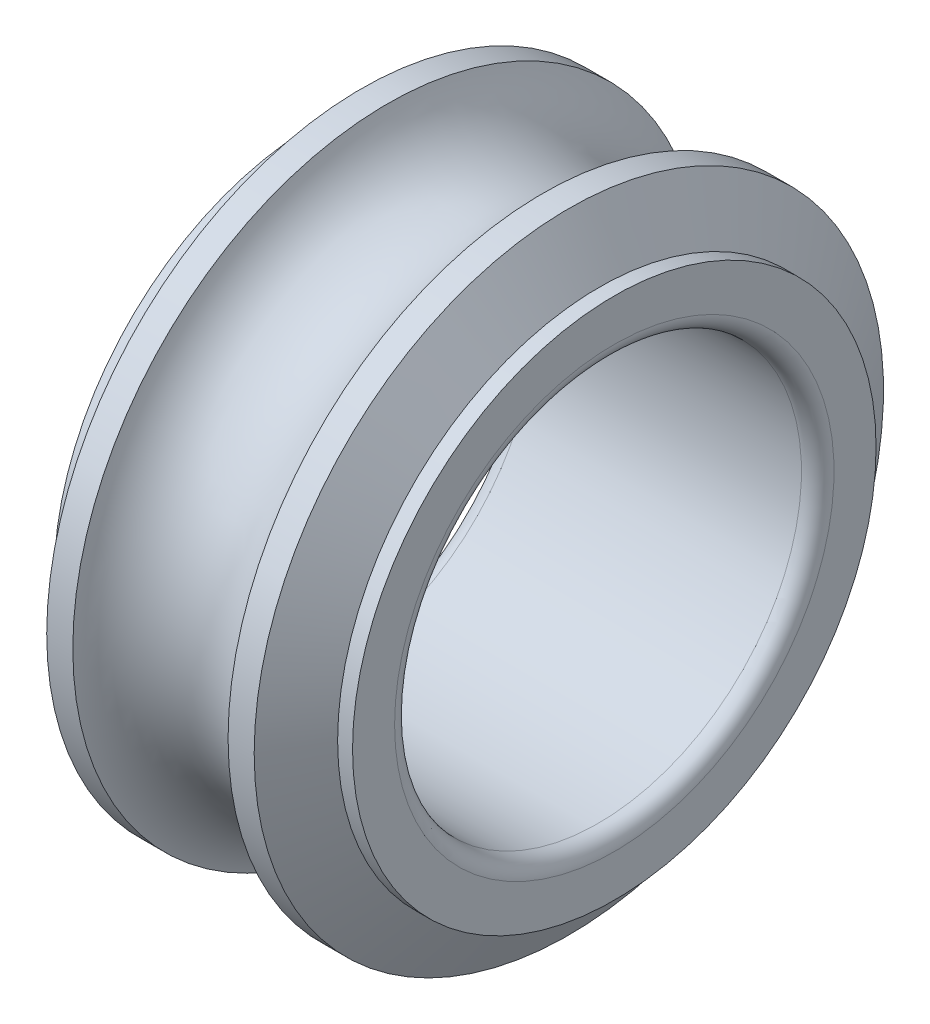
ISO-10303-21;
HEADER;
FILE_DESCRIPTION(('STEP AP214'),'2;1');
FILE_NAME('part.step','',(''),(''),'','','');
FILE_SCHEMA(('AUTOMOTIVE_DESIGN { 1 0 10303 214 1 1 1 1 }'));
ENDSEC;
DATA;
#1=APPLICATION_CONTEXT('core data for automotive mechanical design processes');
#2=APPLICATION_PROTOCOL_DEFINITION('international standard','automotive_design',2000,#1);
#3=PRODUCT_CONTEXT('',#1,'mechanical');
#4=PRODUCT('Part','Part','',(#3));
#5=PRODUCT_RELATED_PRODUCT_CATEGORY('part','',(#4));
#6=PRODUCT_DEFINITION_FORMATION('','',#4);
#7=PRODUCT_DEFINITION_CONTEXT('part definition',#1,'design');
#8=PRODUCT_DEFINITION('design','',#6,#7);
#9=PRODUCT_DEFINITION_SHAPE('','',#8);
#10=(LENGTH_UNIT() NAMED_UNIT(*) SI_UNIT(.MILLI.,.METRE.));
#11=(NAMED_UNIT(*) PLANE_ANGLE_UNIT() SI_UNIT($,.RADIAN.));
#12=(NAMED_UNIT(*) SI_UNIT($,.STERADIAN.) SOLID_ANGLE_UNIT());
#13=UNCERTAINTY_MEASURE_WITH_UNIT(LENGTH_MEASURE(1.E-05),#10,'distance_accuracy_value','');
#14=(GEOMETRIC_REPRESENTATION_CONTEXT(3) GLOBAL_UNCERTAINTY_ASSIGNED_CONTEXT((#13)) GLOBAL_UNIT_ASSIGNED_CONTEXT((#10,
#11,#12)) REPRESENTATION_CONTEXT('',''));
#15=CARTESIAN_POINT('',(0.,0.,0.));
#16=DIRECTION('',(0.,0.,1.));
#17=DIRECTION('',(1.,0.,0.));
#18=AXIS2_PLACEMENT_3D('',#15,#16,#17);
#19=CARTESIAN_POINT('',(10.3999999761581,0.,0.));
#20=DIRECTION('',(-1.,0.,0.));
#21=DIRECTION('',(0.,0.,1.));
#22=AXIS2_PLACEMENT_3D('',#19,#20,#21);
#23=TOROIDAL_SURFACE('',#22,8.10000002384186,0.600000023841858);
#24=CARTESIAN_POINT('',(11.,0.,0.));
#25=DIRECTION('',(-1.,0.,0.));
#26=DIRECTION('',(0.,0.,1.));
#27=AXIS2_PLACEMENT_3D('',#24,#25,#26);
#28=CIRCLE('',#27,8.10000002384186);
#29=CARTESIAN_POINT('',(11.,0.,8.10000002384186));
#30=VERTEX_POINT('',#29);
#31=EDGE_CURVE('E10',#30,#30,#28,.T.);
#32=ORIENTED_EDGE('',*,*,#31,.F.);
#33=EDGE_LOOP('',(#32));
#34=FACE_BOUND('',#33,.T.);
#35=CARTESIAN_POINT('',(10.3999999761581,0.,0.));
#36=DIRECTION('',(-1.,0.,0.));
#37=DIRECTION('',(0.,0.,1.));
#38=AXIS2_PLACEMENT_3D('',#35,#36,#37);
#39=CIRCLE('',#38,7.5);
#40=CARTESIAN_POINT('',(10.3999999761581,0.,7.5));
#41=VERTEX_POINT('',#40);
#42=EDGE_CURVE('E68',#41,#41,#39,.T.);
#43=ORIENTED_EDGE('',*,*,#42,.T.);
#44=EDGE_LOOP('',(#43));
#45=FACE_BOUND('',#44,.T.);
#46=ADVANCED_FACE('F28',(#34,#45),#23,.T.);
#47=CARTESIAN_POINT('',(11.,8.10000002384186,0.));
#48=DIRECTION('',(-1.,0.,0.));
#49=DIRECTION('',(0.,0.,1.));
#50=AXIS2_PLACEMENT_3D('',#47,#48,#49);
#51=PLANE('',#50);
#52=CARTESIAN_POINT('',(11.,0.,0.));
#53=DIRECTION('',(-1.,0.,0.));
#54=DIRECTION('',(0.,0.,1.));
#55=AXIS2_PLACEMENT_3D('',#52,#53,#54);
#56=CIRCLE('',#55,9.65000009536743);
#57=CARTESIAN_POINT('',(11.,0.,9.65000009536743));
#58=VERTEX_POINT('',#57);
#59=EDGE_CURVE('E34',#58,#58,#56,.T.);
#60=ORIENTED_EDGE('',*,*,#59,.F.);
#61=EDGE_LOOP('',(#60));
#62=FACE_BOUND('',#61,.T.);
#63=ORIENTED_EDGE('',*,*,#31,.T.);
#64=EDGE_LOOP('',(#63));
#65=FACE_BOUND('',#64,.T.);
#66=ADVANCED_FACE('F121',(#62,#65),#51,.F.);
#67=CARTESIAN_POINT('',(0.,0.,0.));
#68=DIRECTION('',(-1.,0.,0.));
#69=DIRECTION('',(0.,0.,1.));
#70=AXIS2_PLACEMENT_3D('',#67,#68,#69);
#71=CYLINDRICAL_SURFACE('',#70,9.65000009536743);
#72=CARTESIAN_POINT('',(10.45,0.,0.));
#73=DIRECTION('',(-1.,0.,0.));
#74=DIRECTION('',(0.,0.,1.));
#75=AXIS2_PLACEMENT_3D('',#72,#73,#74);
#76=CIRCLE('',#75,9.65000009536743);
#77=CARTESIAN_POINT('',(10.45,0.,9.65000009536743));
#78=VERTEX_POINT('',#77);
#79=EDGE_CURVE('E38',#78,#78,#76,.T.);
#80=ORIENTED_EDGE('',*,*,#79,.F.);
#81=EDGE_LOOP('',(#80));
#82=FACE_BOUND('',#81,.T.);
#83=ORIENTED_EDGE('',*,*,#59,.T.);
#84=EDGE_LOOP('',(#83));
#85=FACE_BOUND('',#84,.T.);
#86=ADVANCED_FACE('F126',(#82,#85),#71,.T.);
#87=CARTESIAN_POINT('',(10.45,0.,0.));
#88=DIRECTION('',(-1.,0.,0.));
#89=DIRECTION('',(0.,0.,1.));
#90=AXIS2_PLACEMENT_3D('',#87,#88,#89);
#91=CONICAL_SURFACE('',#90,9.65000009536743,1.0471975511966);
#92=CARTESIAN_POINT('',(9.32416703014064,0.,0.));
#93=DIRECTION('',(-1.,0.,0.));
#94=DIRECTION('',(0.,0.,1.));
#95=AXIS2_PLACEMENT_3D('',#92,#93,#94);
#96=CIRCLE('',#95,11.6);
#97=CARTESIAN_POINT('',(9.32416703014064,0.,11.6));
#98=VERTEX_POINT('',#97);
#99=EDGE_CURVE('E42',#98,#98,#96,.T.);
#100=ORIENTED_EDGE('',*,*,#99,.F.);
#101=EDGE_LOOP('',(#100));
#102=FACE_BOUND('',#101,.T.);
#103=ORIENTED_EDGE('',*,*,#79,.T.);
#104=EDGE_LOOP('',(#103));
#105=FACE_BOUND('',#104,.T.);
#106=ADVANCED_FACE('F117',(#102,#105),#91,.T.);
#107=CARTESIAN_POINT('',(0.,0.,0.));
#108=DIRECTION('',(-1.,0.,0.));
#109=DIRECTION('',(0.,0.,1.));
#110=AXIS2_PLACEMENT_3D('',#107,#108,#109);
#111=CYLINDRICAL_SURFACE('',#110,11.6);
#112=CARTESIAN_POINT('',(8.36181760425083,0.,0.));
#113=DIRECTION('',(-1.,0.,0.));
#114=DIRECTION('',(0.,0.,1.));
#115=AXIS2_PLACEMENT_3D('',#112,#113,#114);
#116=CIRCLE('',#115,11.6);
#117=CARTESIAN_POINT('',(8.36181760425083,0.,11.6));
#118=VERTEX_POINT('',#117);
#119=EDGE_CURVE('E47',#118,#118,#116,.T.);
#120=ORIENTED_EDGE('',*,*,#119,.F.);
#121=EDGE_LOOP('',(#120));
#122=FACE_BOUND('',#121,.T.);
#123=ORIENTED_EDGE('',*,*,#99,.T.);
#124=EDGE_LOOP('',(#123));
#125=FACE_BOUND('',#124,.T.);
#126=ADVANCED_FACE('F111',(#122,#125),#111,.T.);
#127=CARTESIAN_POINT('',(5.5,0.,0.));
#128=DIRECTION('',(-1.,0.,0.));
#129=DIRECTION('',(0.,0.,1.));
#130=AXIS2_PLACEMENT_3D('',#127,#128,#129);
#131=TOROIDAL_SURFACE('',#130,12.5,3.);
#132=ORIENTED_EDGE('',*,*,#119,.T.);
#133=EDGE_LOOP('',(#132));
#134=FACE_BOUND('',#133,.T.);
#135=CARTESIAN_POINT('',(2.63818239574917,0.,0.));
#136=DIRECTION('',(-1.,0.,0.));
#137=DIRECTION('',(0.,0.,1.));
#138=AXIS2_PLACEMENT_3D('',#135,#136,#137);
#139=CIRCLE('',#138,11.6);
#140=CARTESIAN_POINT('',(2.63818239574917,0.,11.6));
#141=VERTEX_POINT('',#140);
#142=EDGE_CURVE('E50',#141,#141,#139,.T.);
#143=ORIENTED_EDGE('',*,*,#142,.F.);
#144=EDGE_LOOP('',(#143));
#145=FACE_BOUND('',#144,.T.);
#146=ADVANCED_FACE('F106',(#134,#145),#131,.F.);
#147=CARTESIAN_POINT('',(0.,0.,0.));
#148=DIRECTION('',(-1.,0.,0.));
#149=DIRECTION('',(0.,0.,1.));
#150=AXIS2_PLACEMENT_3D('',#147,#148,#149);
#151=CYLINDRICAL_SURFACE('',#150,11.6);
#152=CARTESIAN_POINT('',(1.67583296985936,0.,0.));
#153=DIRECTION('',(-1.,0.,0.));
#154=DIRECTION('',(0.,0.,1.));
#155=AXIS2_PLACEMENT_3D('',#152,#153,#154);
#156=CIRCLE('',#155,11.6);
#157=CARTESIAN_POINT('',(1.67583296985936,0.,11.6));
#158=VERTEX_POINT('',#157);
#159=EDGE_CURVE('E53',#158,#158,#156,.T.);
#160=ORIENTED_EDGE('',*,*,#159,.F.);
#161=EDGE_LOOP('',(#160));
#162=FACE_BOUND('',#161,.T.);
#163=ORIENTED_EDGE('',*,*,#142,.T.);
#164=EDGE_LOOP('',(#163));
#165=FACE_BOUND('',#164,.T.);
#166=ADVANCED_FACE('F100',(#162,#165),#151,.T.);
#167=CARTESIAN_POINT('',(1.67583296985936,0.,0.));
#168=DIRECTION('',(1.,0.,0.));
#169=DIRECTION('',(0.,0.,-1.));
#170=AXIS2_PLACEMENT_3D('',#167,#168,#169);
#171=CONICAL_SURFACE('',#170,11.6,1.0471975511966);
#172=CARTESIAN_POINT('',(0.55,0.,0.));
#173=DIRECTION('',(-1.,0.,0.));
#174=DIRECTION('',(0.,0.,1.));
#175=AXIS2_PLACEMENT_3D('',#172,#173,#174);
#176=CIRCLE('',#175,9.65000009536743);
#177=CARTESIAN_POINT('',(0.55,0.,9.65000009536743));
#178=VERTEX_POINT('',#177);
#179=EDGE_CURVE('E56',#178,#178,#176,.T.);
#180=ORIENTED_EDGE('',*,*,#179,.F.);
#181=EDGE_LOOP('',(#180));
#182=FACE_BOUND('',#181,.T.);
#183=ORIENTED_EDGE('',*,*,#159,.T.);
#184=EDGE_LOOP('',(#183));
#185=FACE_BOUND('',#184,.T.);
#186=ADVANCED_FACE('F94',(#182,#185),#171,.T.);
#187=CARTESIAN_POINT('',(0.,0.,0.));
#188=DIRECTION('',(-1.,0.,0.));
#189=DIRECTION('',(0.,0.,1.));
#190=AXIS2_PLACEMENT_3D('',#187,#188,#189);
#191=CYLINDRICAL_SURFACE('',#190,9.65000009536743);
#192=CARTESIAN_POINT('',(0.,0.,0.));
#193=DIRECTION('',(-1.,0.,0.));
#194=DIRECTION('',(0.,0.,1.));
#195=AXIS2_PLACEMENT_3D('',#192,#193,#194);
#196=CIRCLE('',#195,9.65000009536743);
#197=CARTESIAN_POINT('',(0.,0.,9.65000009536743));
#198=VERTEX_POINT('',#197);
#199=EDGE_CURVE('E59',#198,#198,#196,.T.);
#200=ORIENTED_EDGE('',*,*,#199,.F.);
#201=EDGE_LOOP('',(#200));
#202=FACE_BOUND('',#201,.T.);
#203=ORIENTED_EDGE('',*,*,#179,.T.);
#204=EDGE_LOOP('',(#203));
#205=FACE_BOUND('',#204,.T.);
#206=ADVANCED_FACE('F88',(#202,#205),#191,.T.);
#207=CARTESIAN_POINT('',(0.,9.65000009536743,0.));
#208=DIRECTION('',(1.,0.,0.));
#209=DIRECTION('',(0.,0.,-1.));
#210=AXIS2_PLACEMENT_3D('',#207,#208,#209);
#211=PLANE('',#210);
#212=CARTESIAN_POINT('',(0.,0.,0.));
#213=DIRECTION('',(-1.,0.,0.));
#214=DIRECTION('',(0.,0.,1.));
#215=AXIS2_PLACEMENT_3D('',#212,#213,#214);
#216=CIRCLE('',#215,8.10000002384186);
#217=CARTESIAN_POINT('',(0.,0.,8.10000002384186));
#218=VERTEX_POINT('',#217);
#219=EDGE_CURVE('E62',#218,#218,#216,.T.);
#220=ORIENTED_EDGE('',*,*,#219,.F.);
#221=EDGE_LOOP('',(#220));
#222=FACE_BOUND('',#221,.T.);
#223=ORIENTED_EDGE('',*,*,#199,.T.);
#224=EDGE_LOOP('',(#223));
#225=FACE_BOUND('',#224,.T.);
#226=ADVANCED_FACE('F82',(#222,#225),#211,.F.);
#227=CARTESIAN_POINT('',(0.600000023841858,0.,0.));
#228=DIRECTION('',(-1.,0.,0.));
#229=DIRECTION('',(0.,0.,1.));
#230=AXIS2_PLACEMENT_3D('',#227,#228,#229);
#231=TOROIDAL_SURFACE('',#230,8.10000002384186,0.600000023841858);
#232=CARTESIAN_POINT('',(0.600000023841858,0.,0.));
#233=DIRECTION('',(-1.,0.,0.));
#234=DIRECTION('',(0.,0.,1.));
#235=AXIS2_PLACEMENT_3D('',#232,#233,#234);
#236=CIRCLE('',#235,7.5);
#237=CARTESIAN_POINT('',(0.600000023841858,0.,7.5));
#238=VERTEX_POINT('',#237);
#239=EDGE_CURVE('E65',#238,#238,#236,.T.);
#240=ORIENTED_EDGE('',*,*,#239,.F.);
#241=EDGE_LOOP('',(#240));
#242=FACE_BOUND('',#241,.T.);
#243=ORIENTED_EDGE('',*,*,#219,.T.);
#244=EDGE_LOOP('',(#243));
#245=FACE_BOUND('',#244,.T.);
#246=ADVANCED_FACE('F76',(#242,#245),#231,.T.);
#247=CARTESIAN_POINT('',(0.,0.,0.));
#248=DIRECTION('',(-1.,0.,0.));
#249=DIRECTION('',(0.,0.,1.));
#250=AXIS2_PLACEMENT_3D('',#247,#248,#249);
#251=CYLINDRICAL_SURFACE('',#250,7.5);
#252=ORIENTED_EDGE('',*,*,#42,.F.);
#253=EDGE_LOOP('',(#252));
#254=FACE_BOUND('',#253,.T.);
#255=ORIENTED_EDGE('',*,*,#239,.T.);
#256=EDGE_LOOP('',(#255));
#257=FACE_BOUND('',#256,.T.);
#258=ADVANCED_FACE('F73',(#254,#257),#251,.F.);
#259=CLOSED_SHELL('',(#46,#66,#86,#106,#126,#146,#166,#186,#206,#226,#246,#258));
#260=MANIFOLD_SOLID_BREP('B2',#259);
#261=ADVANCED_BREP_SHAPE_REPRESENTATION('',(#18,#260),#14);
#262=SHAPE_DEFINITION_REPRESENTATION(#9,#261);
ENDSEC;
END-ISO-10303-21;
